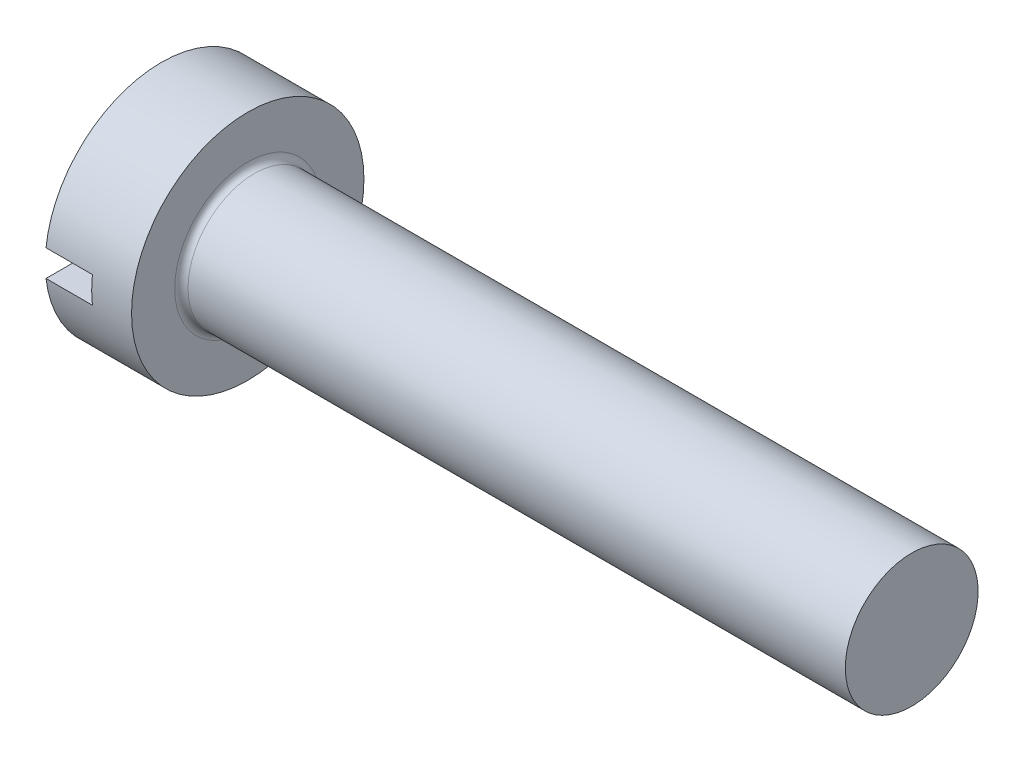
ISO-10303-21;
HEADER;
FILE_DESCRIPTION(('STEP AP214'),'2;1');
FILE_NAME('part.step','',(''),(''),'','','');
FILE_SCHEMA(('AUTOMOTIVE_DESIGN { 1 0 10303 214 1 1 1 1 }'));
ENDSEC;
DATA;
#1=APPLICATION_CONTEXT('core data for automotive mechanical design processes');
#2=APPLICATION_PROTOCOL_DEFINITION('international standard','automotive_design',2000,#1);
#3=PRODUCT_CONTEXT('',#1,'mechanical');
#4=PRODUCT('Part','Part','',(#3));
#5=PRODUCT_RELATED_PRODUCT_CATEGORY('part','',(#4));
#6=PRODUCT_DEFINITION_FORMATION('','',#4);
#7=PRODUCT_DEFINITION_CONTEXT('part definition',#1,'design');
#8=PRODUCT_DEFINITION('design','',#6,#7);
#9=PRODUCT_DEFINITION_SHAPE('','',#8);
#10=(LENGTH_UNIT() NAMED_UNIT(*) SI_UNIT(.MILLI.,.METRE.));
#11=(NAMED_UNIT(*) PLANE_ANGLE_UNIT() SI_UNIT($,.RADIAN.));
#12=(NAMED_UNIT(*) SI_UNIT($,.STERADIAN.) SOLID_ANGLE_UNIT());
#13=UNCERTAINTY_MEASURE_WITH_UNIT(LENGTH_MEASURE(1.E-05),#10,'distance_accuracy_value','');
#14=(GEOMETRIC_REPRESENTATION_CONTEXT(3) GLOBAL_UNCERTAINTY_ASSIGNED_CONTEXT((#13)) GLOBAL_UNIT_ASSIGNED_CONTEXT((#10,
#11,#12)) REPRESENTATION_CONTEXT('',''));
#15=CARTESIAN_POINT('',(0.,0.,0.));
#16=DIRECTION('',(0.,0.,1.));
#17=DIRECTION('',(1.,0.,0.));
#18=AXIS2_PLACEMENT_3D('',#15,#16,#17);
#19=CARTESIAN_POINT('',(0.,7.,0.));
#20=DIRECTION('',(1.,0.,0.));
#21=DIRECTION('',(0.,0.,-1.));
#22=AXIS2_PLACEMENT_3D('',#19,#20,#21);
#23=PLANE('',#22);
#24=DIRECTION('',(0.,0.,1.));
#25=VECTOR('',#24,1.);
#26=CARTESIAN_POINT('',(0.,0.800000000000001,-7.));
#27=LINE('',#26,#25);
#28=CARTESIAN_POINT('',(0.,0.800000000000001,-6.95413546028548));
#29=VERTEX_POINT('',#28);
#30=CARTESIAN_POINT('',(0.,0.799999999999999,6.95413546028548));
#31=VERTEX_POINT('',#30);
#32=EDGE_CURVE('E81',#29,#31,#27,.T.);
#33=ORIENTED_EDGE('',*,*,#32,.T.);
#34=CARTESIAN_POINT('',(0.,0.,0.));
#35=DIRECTION('',(-1.,0.,0.));
#36=DIRECTION('',(0.,0.,1.));
#37=AXIS2_PLACEMENT_3D('',#34,#35,#36);
#38=CIRCLE('',#37,7.);
#39=EDGE_CURVE('E92',#31,#29,#38,.T.);
#40=ORIENTED_EDGE('',*,*,#39,.T.);
#41=EDGE_LOOP('',(#33,#40));
#42=FACE_BOUND('',#41,.T.);
#43=ADVANCED_FACE('F33',(#42),#23,.F.);
#44=DIRECTION('',(0.,0.,-1.));
#45=VECTOR('',#44,1.);
#46=CARTESIAN_POINT('',(0.,-0.799999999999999,-7.));
#47=LINE('',#46,#45);
#48=CARTESIAN_POINT('',(0.,-0.800000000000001,6.95413546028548));
#49=VERTEX_POINT('',#48);
#50=CARTESIAN_POINT('',(0.,-0.799999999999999,-6.95413546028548));
#51=VERTEX_POINT('',#50);
#52=EDGE_CURVE('E71',#49,#51,#47,.T.);
#53=ORIENTED_EDGE('',*,*,#52,.T.);
#54=EDGE_CURVE('E86',#51,#49,#38,.T.);
#55=ORIENTED_EDGE('',*,*,#54,.T.);
#56=EDGE_LOOP('',(#53,#55));
#57=FACE_BOUND('',#56,.T.);
#58=ADVANCED_FACE('F91',(#57),#23,.F.);
#59=CARTESIAN_POINT('',(0.,0.,0.));
#60=DIRECTION('',(-1.,0.,0.));
#61=DIRECTION('',(0.,0.,1.));
#62=AXIS2_PLACEMENT_3D('',#59,#60,#61);
#63=CYLINDRICAL_SURFACE('',#62,7.);
#64=CARTESIAN_POINT('',(5.2,0.,0.));
#65=DIRECTION('',(-1.,0.,0.));
#66=DIRECTION('',(0.,0.,1.));
#67=AXIS2_PLACEMENT_3D('',#64,#65,#66);
#68=CIRCLE('',#67,7.);
#69=CARTESIAN_POINT('',(5.2,0.,7.));
#70=VERTEX_POINT('',#69);
#71=EDGE_CURVE('E95',#70,#70,#68,.T.);
#72=ORIENTED_EDGE('',*,*,#71,.T.);
#73=EDGE_LOOP('',(#72));
#74=FACE_BOUND('',#73,.T.);
#75=DIRECTION('',(-1.,0.,0.));
#76=VECTOR('',#75,1.);
#77=CARTESIAN_POINT('',(0.,0.800000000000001,-6.95413546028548));
#78=LINE('',#77,#76);
#79=CARTESIAN_POINT('',(2.8,0.800000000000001,-6.95413546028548));
#80=VERTEX_POINT('',#79);
#81=EDGE_CURVE('E11',#29,#80,#78,.F.);
#82=ORIENTED_EDGE('',*,*,#81,.F.);
#83=ORIENTED_EDGE('',*,*,#39,.F.);
#84=DIRECTION('',(-1.,0.,0.));
#85=VECTOR('',#84,1.);
#86=CARTESIAN_POINT('',(0.,0.799999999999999,6.95413546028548));
#87=LINE('',#86,#85);
#88=CARTESIAN_POINT('',(2.8,0.799999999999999,6.95413546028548));
#89=VERTEX_POINT('',#88);
#90=EDGE_CURVE('E89',#89,#31,#87,.T.);
#91=ORIENTED_EDGE('',*,*,#90,.F.);
#92=CARTESIAN_POINT('',(2.8,0.,0.));
#93=DIRECTION('',(-1.,0.,0.));
#94=DIRECTION('',(0.,0.,1.));
#95=AXIS2_PLACEMENT_3D('',#92,#93,#94);
#96=CIRCLE('',#95,7.);
#97=CARTESIAN_POINT('',(2.8,-0.800000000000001,6.95413546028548));
#98=VERTEX_POINT('',#97);
#99=EDGE_CURVE('E88',#98,#89,#96,.T.);
#100=ORIENTED_EDGE('',*,*,#99,.F.);
#101=DIRECTION('',(-1.,0.,0.));
#102=VECTOR('',#101,1.);
#103=CARTESIAN_POINT('',(0.,-0.800000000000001,6.95413546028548));
#104=LINE('',#103,#102);
#105=EDGE_CURVE('E74',#49,#98,#104,.F.);
#106=ORIENTED_EDGE('',*,*,#105,.F.);
#107=ORIENTED_EDGE('',*,*,#54,.F.);
#108=DIRECTION('',(-1.,0.,0.));
#109=VECTOR('',#108,1.);
#110=CARTESIAN_POINT('',(0.,-0.799999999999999,-6.95413546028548));
#111=LINE('',#110,#109);
#112=CARTESIAN_POINT('',(2.8,-0.799999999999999,-6.95413546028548));
#113=VERTEX_POINT('',#112);
#114=EDGE_CURVE('E41',#113,#51,#111,.T.);
#115=ORIENTED_EDGE('',*,*,#114,.F.);
#116=EDGE_CURVE('E53',#80,#113,#96,.T.);
#117=ORIENTED_EDGE('',*,*,#116,.F.);
#118=EDGE_LOOP('',(#82,#83,#91,#100,#106,#107,#115,#117));
#119=FACE_BOUND('',#118,.T.);
#120=ADVANCED_FACE('F85',(#74,#119),#63,.T.);
#121=CARTESIAN_POINT('',(45.2,4.,0.));
#122=DIRECTION('',(-1.,0.,0.));
#123=DIRECTION('',(0.,0.,1.));
#124=AXIS2_PLACEMENT_3D('',#121,#122,#123);
#125=PLANE('',#124);
#126=CARTESIAN_POINT('',(45.2,0.,0.));
#127=DIRECTION('',(-1.,0.,0.));
#128=DIRECTION('',(0.,0.,1.));
#129=AXIS2_PLACEMENT_3D('',#126,#127,#128);
#130=CIRCLE('',#129,4.);
#131=CARTESIAN_POINT('',(45.2,0.,4.));
#132=VERTEX_POINT('',#131);
#133=EDGE_CURVE('E101',#132,#132,#130,.T.);
#134=ORIENTED_EDGE('',*,*,#133,.F.);
#135=EDGE_LOOP('',(#134));
#136=FACE_BOUND('',#135,.T.);
#137=ADVANCED_FACE('F130',(#136),#125,.F.);
#138=CARTESIAN_POINT('',(0.,0.,0.));
#139=DIRECTION('',(-1.,0.,0.));
#140=DIRECTION('',(0.,0.,1.));
#141=AXIS2_PLACEMENT_3D('',#138,#139,#140);
#142=CYLINDRICAL_SURFACE('',#141,4.);
#143=CARTESIAN_POINT('',(5.6,0.,0.));
#144=DIRECTION('',(-1.,0.,0.));
#145=DIRECTION('',(0.,0.,1.));
#146=AXIS2_PLACEMENT_3D('',#143,#144,#145);
#147=CIRCLE('',#146,4.);
#148=CARTESIAN_POINT('',(5.6,0.,4.));
#149=VERTEX_POINT('',#148);
#150=EDGE_CURVE('E107',#149,#149,#147,.F.);
#151=ORIENTED_EDGE('',*,*,#150,.T.);
#152=EDGE_LOOP('',(#151));
#153=FACE_BOUND('',#152,.T.);
#154=ORIENTED_EDGE('',*,*,#133,.T.);
#155=EDGE_LOOP('',(#154));
#156=FACE_BOUND('',#155,.T.);
#157=ADVANCED_FACE('F133',(#153,#156),#142,.T.);
#158=CARTESIAN_POINT('',(5.2,7.,0.));
#159=DIRECTION('',(-1.,0.,0.));
#160=DIRECTION('',(0.,0.,1.));
#161=AXIS2_PLACEMENT_3D('',#158,#159,#160);
#162=PLANE('',#161);
#163=CARTESIAN_POINT('',(5.2,0.,0.));
#164=DIRECTION('',(-1.,0.,0.));
#165=DIRECTION('',(0.,0.,1.));
#166=AXIS2_PLACEMENT_3D('',#163,#164,#165);
#167=CIRCLE('',#166,4.4);
#168=CARTESIAN_POINT('',(5.2,0.,4.4));
#169=VERTEX_POINT('',#168);
#170=EDGE_CURVE('E104',#169,#169,#167,.T.);
#171=ORIENTED_EDGE('',*,*,#170,.T.);
#172=EDGE_LOOP('',(#171));
#173=FACE_BOUND('',#172,.T.);
#174=ORIENTED_EDGE('',*,*,#71,.F.);
#175=EDGE_LOOP('',(#174));
#176=FACE_BOUND('',#175,.T.);
#177=ADVANCED_FACE('F137',(#173,#176),#162,.F.);
#178=CARTESIAN_POINT('',(5.6,0.,0.));
#179=DIRECTION('',(-1.,0.,0.));
#180=DIRECTION('',(0.,0.,1.));
#181=AXIS2_PLACEMENT_3D('',#178,#179,#180);
#182=TOROIDAL_SURFACE('',#181,4.4,0.4);
#183=ORIENTED_EDGE('',*,*,#150,.F.);
#184=EDGE_LOOP('',(#183));
#185=FACE_BOUND('',#184,.T.);
#186=ORIENTED_EDGE('',*,*,#170,.F.);
#187=EDGE_LOOP('',(#186));
#188=FACE_BOUND('',#187,.T.);
#189=ADVANCED_FACE('F35',(#185,#188),#182,.F.);
#190=CARTESIAN_POINT('',(2.8,0.800000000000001,-7.));
#191=DIRECTION('',(0.,-1.,0.));
#192=DIRECTION('',(0.,0.,-1.));
#193=AXIS2_PLACEMENT_3D('',#190,#191,#192);
#194=PLANE('',#193);
#195=ORIENTED_EDGE('',*,*,#90,.T.);
#196=ORIENTED_EDGE('',*,*,#32,.F.);
#197=ORIENTED_EDGE('',*,*,#81,.T.);
#198=DIRECTION('',(0.,0.,1.));
#199=VECTOR('',#198,1.);
#200=CARTESIAN_POINT('',(2.8,0.800000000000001,-7.));
#201=LINE('',#200,#199);
#202=EDGE_CURVE('E80',#80,#89,#201,.T.);
#203=ORIENTED_EDGE('',*,*,#202,.T.);
#204=EDGE_LOOP('',(#195,#196,#197,#203));
#205=FACE_BOUND('',#204,.T.);
#206=ADVANCED_FACE('F114',(#205),#194,.T.);
#207=CARTESIAN_POINT('',(2.8,-0.799999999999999,-7.));
#208=DIRECTION('',(0.,1.,0.));
#209=DIRECTION('',(0.,0.,1.));
#210=AXIS2_PLACEMENT_3D('',#207,#208,#209);
#211=PLANE('',#210);
#212=ORIENTED_EDGE('',*,*,#114,.T.);
#213=ORIENTED_EDGE('',*,*,#52,.F.);
#214=ORIENTED_EDGE('',*,*,#105,.T.);
#215=DIRECTION('',(0.,0.,-1.));
#216=VECTOR('',#215,1.);
#217=CARTESIAN_POINT('',(2.8,-0.799999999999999,-7.));
#218=LINE('',#217,#216);
#219=EDGE_CURVE('E48',#98,#113,#218,.T.);
#220=ORIENTED_EDGE('',*,*,#219,.T.);
#221=EDGE_LOOP('',(#212,#213,#214,#220));
#222=FACE_BOUND('',#221,.T.);
#223=ADVANCED_FACE('F73',(#222),#211,.T.);
#224=CARTESIAN_POINT('',(2.8,0.800000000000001,-7.));
#225=DIRECTION('',(-1.,0.,0.));
#226=DIRECTION('',(0.,0.,1.));
#227=AXIS2_PLACEMENT_3D('',#224,#225,#226);
#228=PLANE('',#227);
#229=ORIENTED_EDGE('',*,*,#202,.F.);
#230=ORIENTED_EDGE('',*,*,#116,.T.);
#231=ORIENTED_EDGE('',*,*,#219,.F.);
#232=ORIENTED_EDGE('',*,*,#99,.T.);
#233=EDGE_LOOP('',(#229,#230,#231,#232));
#234=FACE_BOUND('',#233,.T.);
#235=ADVANCED_FACE('F117',(#234),#228,.T.);
#236=CLOSED_SHELL('',(#43,#58,#120,#137,#157,#177,#189,#206,#223,#235));
#237=MANIFOLD_SOLID_BREP('B2',#236);
#238=ADVANCED_BREP_SHAPE_REPRESENTATION('',(#18,#237),#14);
#239=SHAPE_DEFINITION_REPRESENTATION(#9,#238);
ENDSEC;
END-ISO-10303-21;
